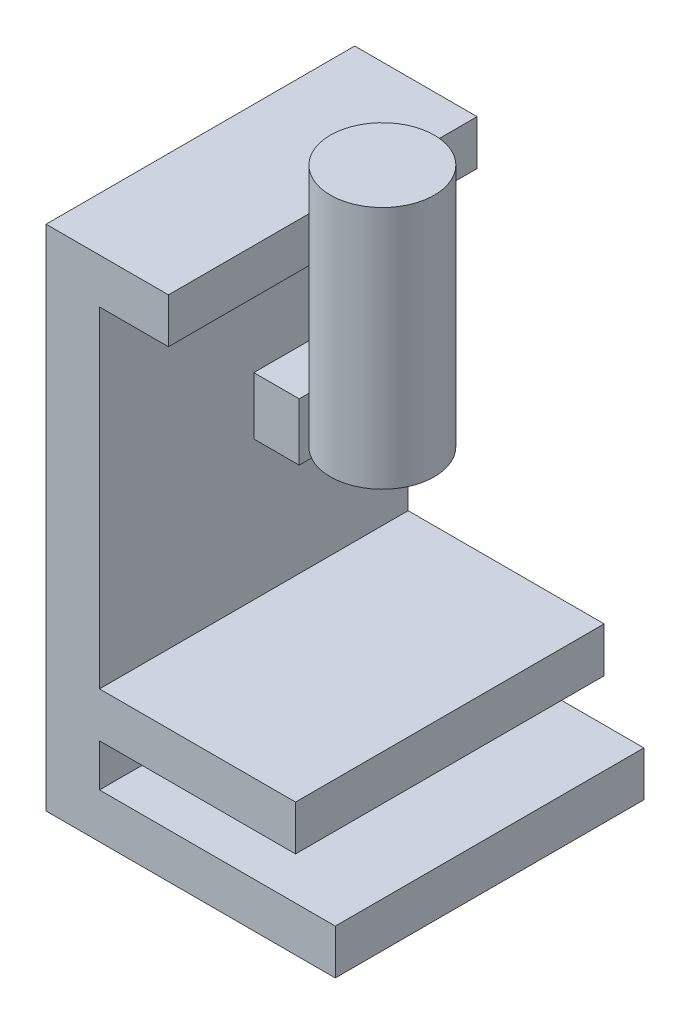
from build123d import *

# Parameters (mm, degrees)
EXTRUDE1_DEPTH      = 47.5
CUT_EXTRUDE1_REACH  = 190.764
SKETCH3_W           = 13.972525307
SKETCH3_H           = 47.5
BOSS_EXTRUDE1_START = 10
SKETCH2_R           = 15.997741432
BOSS_EXTRUDE1_DEPTH = 75.097987


with BuildPart() as part:
    # Sketch1 → Extrude1 (new, symmetric)
    with BuildSketch(Plane(origin=(8.56426308, -28.387824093, 0), x_dir=(0, 1, 0), z_dir=(0, 0, 1))):
        Polygon((-58.163386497, -54.421285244), (98.277260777, -54.421285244), (98.277260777, -92.090296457), (84.43636424, -92.090296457), (84.43636424, -70.863158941), (43.179274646, -70.863158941), (43.179274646, -84.835684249), (25.496253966, -84.835684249), (25.496253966, -70.863158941), (-17.378927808, -70.863158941), (-17.378927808, -131.201948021), (-31.219824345, -131.201948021), (-31.219824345, -70.863158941), (-44.32248996, -70.863158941), (-44.32248996, -143.440294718), (-58.163386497, -143.440294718), align=None)
    extrude(amount=EXTRUDE1_DEPTH, both=True)

    # Sketch3 → Cut-Extrude1 (cut, up to next)
    with BuildSketch(Plane(origin=(0, 14.791450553, 0), x_dir=(-1, 0, 0), z_dir=(0, 1, 0)), mode=Mode.PRIVATE) as cut_extrude1_sk1:
        with Locations((-86.413684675, 23.75)):
            Rectangle(SKETCH3_W, SKETCH3_H)
    cut_extrude1_tool1 = extrude(cut_extrude1_sk1.sketch, amount=-CUT_EXTRUDE1_REACH, mode=Mode.PRIVATE) & part.part
    add(cut_extrude1_tool1.solids().sort_by_distance((86.413685, 14.791451, 23.75))[0], mode=Mode.SUBTRACT)


with BuildPart() as body_2:
    # Sketch2 → Boss-Extrude1 (new body)
    with BuildSketch(Plane(origin=(0, 79.889436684, 0), x_dir=(-1, 0, 0), z_dir=(0, 1, 0)).offset(BOSS_EXTRUDE1_START)):
        with Locations((-118.997137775, 0)):
            Circle(SKETCH2_R)
    extrude(amount=-BOSS_EXTRUDE1_DEPTH)


solid = Compound([part.part, body_2.part])
